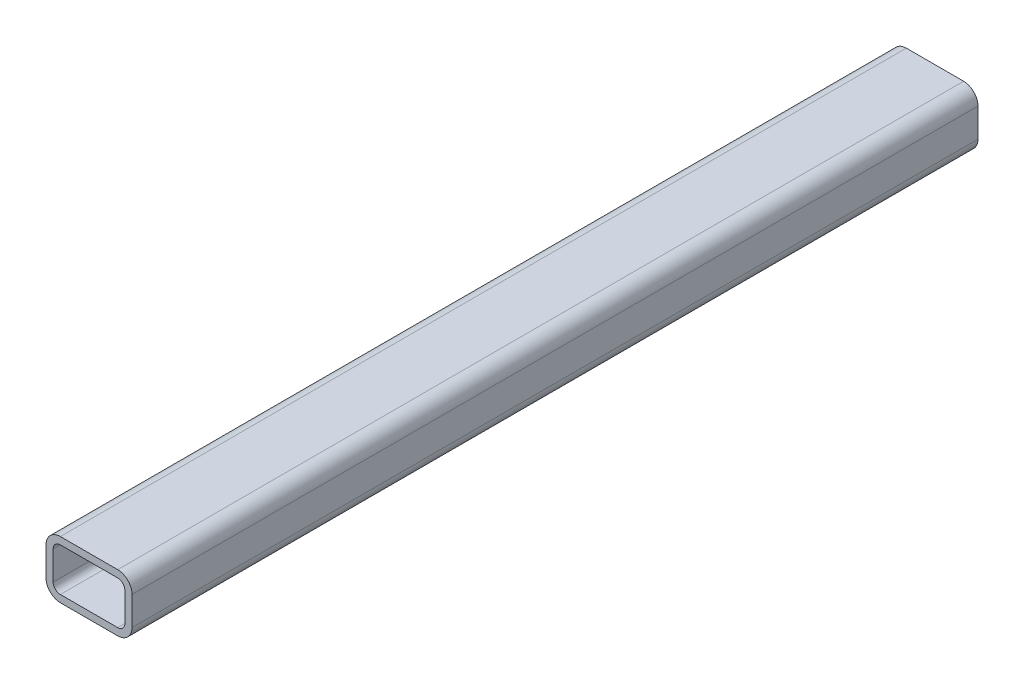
from build123d import *

# Parameters (mm, degrees)
BASE_EXTRUDE_THIN_DEPTH = 749.3


with BuildPart() as part:
    # Sketch1 → Base-Extrude-Thin (new body)
    with BuildSketch(Plane.XY):
        with BuildLine():
            Line((38.1, 12.7), (38.1, -12.7))
            ThreePointArc((38.1, -12.7), (34.380256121, -21.680256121), (25.4, -25.4))
            Line((25.4, -25.4), (-25.4, -25.4))
            ThreePointArc((-25.4, -25.4), (-34.380256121, -21.680256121), (-38.1, -12.7))
            Line((-38.1, -12.7), (-38.1, 12.7))
            ThreePointArc((-38.1, 12.7), (-34.380256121, 21.680256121), (-25.4, 25.4))
            Line((-25.4, 25.4), (25.4, 25.4))
            ThreePointArc((25.4, 25.4), (34.380256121, 21.680256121), (38.1, 12.7))
        make_face()
        with BuildLine():
            Line((31.75, 12.7), (31.75, -12.7))
            ThreePointArc((31.75, -12.7), (29.890128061, -17.190128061), (25.4, -19.05))
            Line((25.4, -19.05), (-25.4, -19.05))
            ThreePointArc((-25.4, -19.05), (-29.890128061, -17.190128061), (-31.75, -12.7))
            Line((-31.75, -12.7), (-31.75, 12.7))
            ThreePointArc((-31.75, 12.7), (-29.890128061, 17.190128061), (-25.4, 19.05))
            Line((-25.4, 19.05), (25.4, 19.05))
            ThreePointArc((25.4, 19.05), (29.890128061, 17.190128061), (31.75, 12.7))
        make_face(mode=Mode.SUBTRACT)
    extrude(amount=BASE_EXTRUDE_THIN_DEPTH)


solid = part.part
